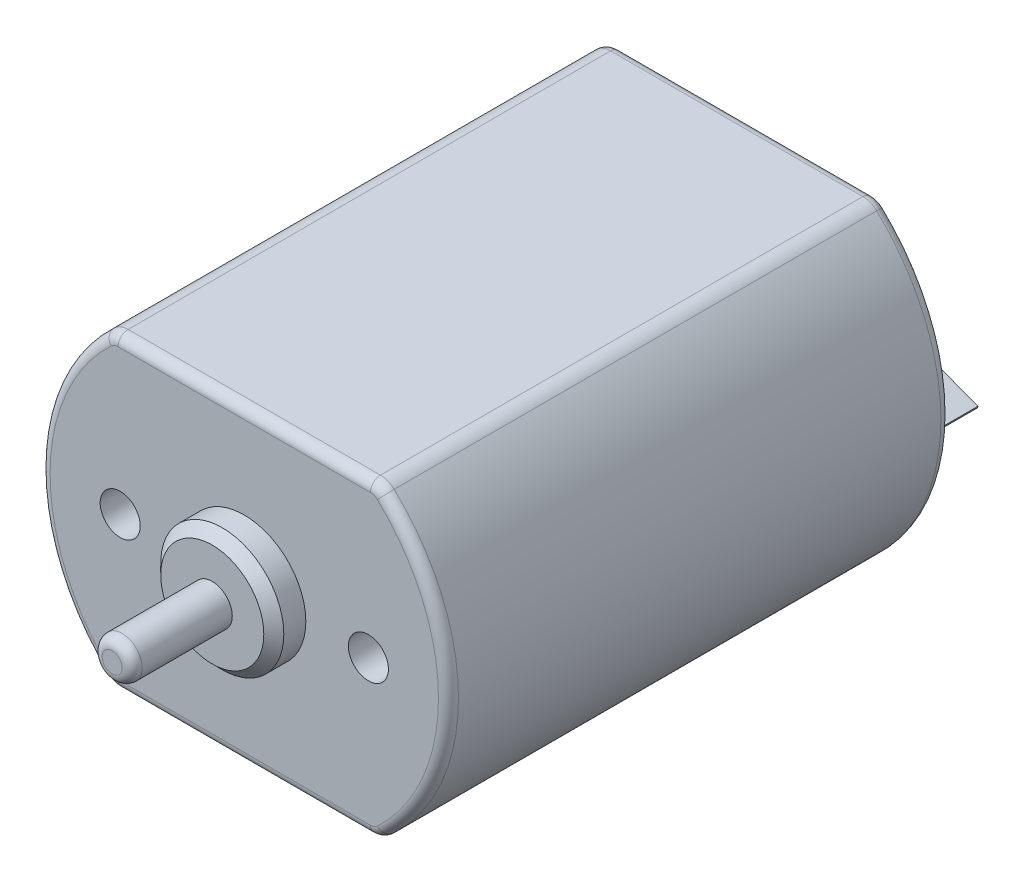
from build123d import *

# Parameters (mm, degrees)
BOSS_EXTRUDE1_DEPTH       = 25.1
BOSS_EXTRUDE2_DEPTH       = 3
BOSS_EXTRUDE3_DEPTH       = 3
SKETCH4_W                 = 3.075
SKETCH4_H                 = 2.1
F_1_CLEARANCE_HOLE1_D     = 2
F_1_CLEARANCE_HOLE1_DEPTH = 4
FILLET1_R                 = 1
CHAMFER1_SIZE2            = 0.500035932
CHAMFER1_SIZE             = 0.500030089
FILLET2_R                 = 0.5


with BuildPart() as part:
    # Sketch1 → Boss-Extrude1 (new body)
    with BuildSketch(Plane.XY.offset(12.55)):
        with BuildLine():
            Line((-6.68954408, -7.7), (6.68954408, -7.7))
            ThreePointArc((6.68954408, -7.7), (10.2, 0), (6.68954408, 7.7))
            Line((6.68954408, 7.7), (-6.68954408, 7.7))
            ThreePointArc((-6.68954408, 7.7), (-10.2, 0), (-6.68954408, -7.7))
        make_face()
    extrude(amount=-BOSS_EXTRUDE1_DEPTH)

    # Sketch2 → Boss-Extrude2 (add)
    with BuildSketch(Plane(origin=(0, 0, -12.55), x_dir=(-1, 0, 0), z_dir=(0, 0, -1))):
        Polygon((-8.51916182, -2.087040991), (-8.554182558, -1.993373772), (-6.68083818, -1.292959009), (-6.645817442, -1.386626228), align=None)
    extrude(amount=BOSS_EXTRUDE2_DEPTH)

    # Sketch3 → Boss-Extrude3 (add)
    with BuildSketch(Plane(origin=(0, 0, -12.55), x_dir=(-1, 0, 0), z_dir=(0, 0, -1))):
        Polygon((6.68083818, 1.292959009), (6.645817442, 1.386626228), (8.51916182, 2.087040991), (8.554182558, 1.993373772), align=None)
    extrude(amount=BOSS_EXTRUDE3_DEPTH)

    # Sketch4 → Revolve1 (revolve)
    with BuildSketch(Plane.XZ, mode=Mode.PRIVATE) as revolve1_sk:
        with Locations((1.5375, -13.6)):
            Rectangle(SKETCH4_W, SKETCH4_H)
    revolve(revolve1_sk.sketch.rotate(Axis((0, 0, -12.55), (0, 0, -1)), 180), axis=Axis((0, 0, -12.55), (0, 0, -1)))

    # Sketch5 → Revolve2 (revolve)
    with BuildSketch(Plane(origin=(0, 0, 0), x_dir=(1, 0, 0), z_dir=(0, 1, 0))):
        Polygon((3.075, -12.55), (0, -12.55), (0, -19.15), (1, -19.15), (1, -14.15), (3.075, -14.15), align=None)
    revolve(axis=Axis((0, 0, 12.55), (0, 0, 1)))

    # 1 Clearance Hole1
    with Locations(Plane.XY.offset(12.55)):
        with Locations((6.2, 0), (-6.2, 0)):
            Hole(F_1_CLEARANCE_HOLE1_D / 2, depth=F_1_CLEARANCE_HOLE1_DEPTH)

    # Fillet1
    fillet1_edges = [part.edges().sort_by_distance(p)[0] for p in [
        (-6.68954408, 7.7, 0),
        (6.68954408, 7.7, 0),
        (6.68954408, -7.7, 0),
        (-6.68954408, -7.7, 0),
    ]]
    fillet(fillet1_edges, radius=FILLET1_R)

    # Chamfer1
    chamfer1_edges = [part.edges().sort_by_distance(p)[0] for p in [
        (3.075, 0, -14.65),
        (-3.075, 0, 14.15),
    ]]
    chamfer(chamfer1_edges, length=CHAMFER1_SIZE, length2=CHAMFER1_SIZE2)

    # Fillet2
    fillet2_edges = [part.edges().sort_by_distance(p)[0] for p in [
        (-1, 0, 19.15),
        (-10.2, 0, 12.55),
        (-10.2, 0, -12.55),
        (0, -7.7, 12.55),
        (10.2, 0, 12.55),
        (0, 7.7, 12.55),
        (6.673364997, 7.629586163, 12.55),
        (6.673364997, -7.629586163, 12.55),
        (-6.673364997, 7.629586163, 12.55),
        (-6.673364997, -7.629586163, 12.55),
        (0, -7.7, -12.55),
        (0, 7.7, -12.55),
        (10.2, 0, -12.55),
        (6.673364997, 7.629586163, -12.55),
        (6.673364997, -7.629586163, -12.55),
        (-6.673364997, 7.629586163, -12.55),
        (-6.673364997, -7.629586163, -12.55),
    ]]
    fillet(fillet2_edges, radius=FILLET2_R)


solid = part.part
